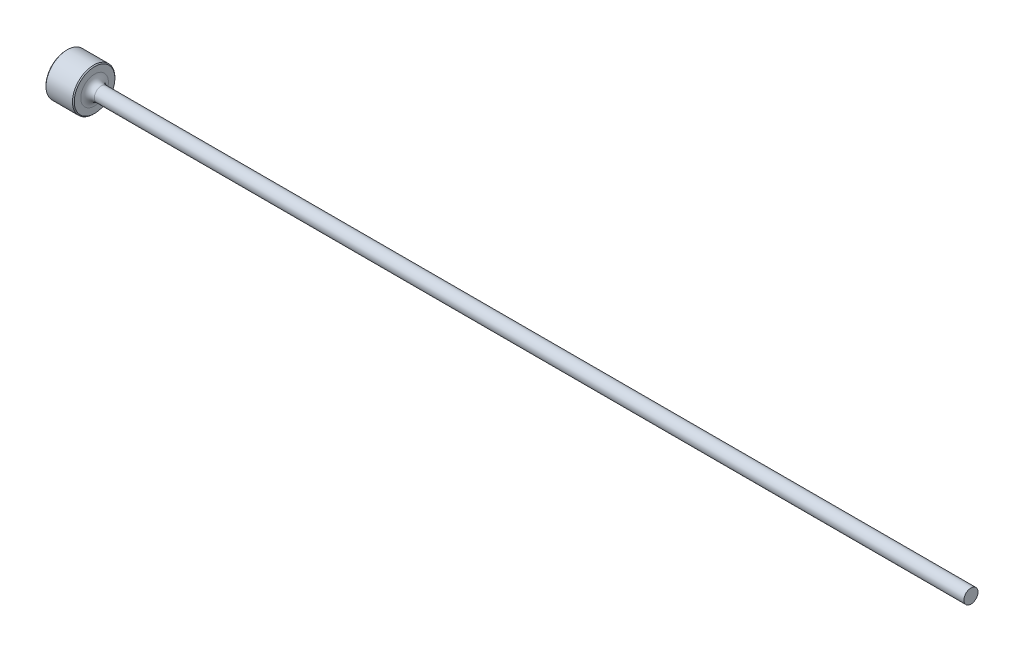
ISO-10303-21;
HEADER;
FILE_DESCRIPTION(('STEP AP214'),'2;1');
FILE_NAME('part.step','',(''),(''),'','','');
FILE_SCHEMA(('AUTOMOTIVE_DESIGN { 1 0 10303 214 1 1 1 1 }'));
ENDSEC;
DATA;
#1=APPLICATION_CONTEXT('core data for automotive mechanical design processes');
#2=APPLICATION_PROTOCOL_DEFINITION('international standard','automotive_design',2000,#1);
#3=PRODUCT_CONTEXT('',#1,'mechanical');
#4=PRODUCT('Part','Part','',(#3));
#5=PRODUCT_RELATED_PRODUCT_CATEGORY('part','',(#4));
#6=PRODUCT_DEFINITION_FORMATION('','',#4);
#7=PRODUCT_DEFINITION_CONTEXT('part definition',#1,'design');
#8=PRODUCT_DEFINITION('design','',#6,#7);
#9=PRODUCT_DEFINITION_SHAPE('','',#8);
#10=(LENGTH_UNIT() NAMED_UNIT(*) SI_UNIT(.MILLI.,.METRE.));
#11=(NAMED_UNIT(*) PLANE_ANGLE_UNIT() SI_UNIT($,.RADIAN.));
#12=(NAMED_UNIT(*) SI_UNIT($,.STERADIAN.) SOLID_ANGLE_UNIT());
#13=UNCERTAINTY_MEASURE_WITH_UNIT(LENGTH_MEASURE(1.E-05),#10,'distance_accuracy_value','');
#14=(GEOMETRIC_REPRESENTATION_CONTEXT(3) GLOBAL_UNCERTAINTY_ASSIGNED_CONTEXT((#13)) GLOBAL_UNIT_ASSIGNED_CONTEXT((#10,
#11,#12)) REPRESENTATION_CONTEXT('',''));
#15=CARTESIAN_POINT('',(0.,0.,0.));
#16=DIRECTION('',(0.,0.,1.));
#17=DIRECTION('',(1.,0.,0.));
#18=AXIS2_PLACEMENT_3D('',#15,#16,#17);
#19=CARTESIAN_POINT('',(101.6,0.789939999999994,0.));
#20=DIRECTION('',(1.,0.,0.));
#21=DIRECTION('',(0.,1.,0.));
#22=AXIS2_PLACEMENT_3D('',#19,#20,#21);
#23=PLANE('',#22);
#24=CARTESIAN_POINT('',(101.6,0.,0.));
#25=DIRECTION('',(1.,0.,0.));
#26=DIRECTION('',(0.,1.,0.));
#27=AXIS2_PLACEMENT_3D('',#24,#25,#26);
#28=CIRCLE('',#27,0.78994);
#29=CARTESIAN_POINT('',(101.6,0.789939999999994,0.));
#30=VERTEX_POINT('',#29);
#31=EDGE_CURVE('E50',#30,#30,#28,.T.);
#32=ORIENTED_EDGE('',*,*,#31,.T.);
#33=EDGE_LOOP('',(#32));
#34=FACE_BOUND('',#33,.T.);
#35=ADVANCED_FACE('F30',(#34),#23,.T.);
#36=CARTESIAN_POINT('',(101.6,0.,0.));
#37=DIRECTION('',(1.,0.,0.));
#38=DIRECTION('',(0.,1.,0.));
#39=AXIS2_PLACEMENT_3D('',#36,#37,#38);
#40=CYLINDRICAL_SURFACE('',#39,0.789939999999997);
#41=CARTESIAN_POINT('',(3.937,0.,0.));
#42=DIRECTION('',(1.,0.,0.));
#43=DIRECTION('',(0.,1.,0.));
#44=AXIS2_PLACEMENT_3D('',#41,#42,#43);
#45=CIRCLE('',#44,0.789939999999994);
#46=CARTESIAN_POINT('',(3.937,0.789939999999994,0.));
#47=VERTEX_POINT('',#46);
#48=EDGE_CURVE('E53',#47,#47,#45,.T.);
#49=ORIENTED_EDGE('',*,*,#48,.T.);
#50=EDGE_LOOP('',(#49));
#51=FACE_BOUND('',#50,.T.);
#52=ORIENTED_EDGE('',*,*,#31,.F.);
#53=EDGE_LOOP('',(#52));
#54=FACE_BOUND('',#53,.T.);
#55=ADVANCED_FACE('F74',(#51,#54),#40,.T.);
#56=CARTESIAN_POINT('',(3.937,0.,0.));
#57=DIRECTION('',(1.,0.,0.));
#58=DIRECTION('',(0.,1.,0.));
#59=AXIS2_PLACEMENT_3D('',#56,#57,#58);
#60=TOROIDAL_SURFACE('',#59,1.55193999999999,0.762);
#61=CARTESIAN_POINT('',(3.175,0.,0.));
#62=DIRECTION('',(1.,0.,0.));
#63=DIRECTION('',(0.,1.,0.));
#64=AXIS2_PLACEMENT_3D('',#61,#62,#63);
#65=CIRCLE('',#64,1.55193999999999);
#66=CARTESIAN_POINT('',(3.175,1.55193999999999,0.));
#67=VERTEX_POINT('',#66);
#68=EDGE_CURVE('E56',#67,#67,#65,.T.);
#69=ORIENTED_EDGE('',*,*,#68,.T.);
#70=EDGE_LOOP('',(#69));
#71=FACE_BOUND('',#70,.T.);
#72=ORIENTED_EDGE('',*,*,#48,.F.);
#73=EDGE_LOOP('',(#72));
#74=FACE_BOUND('',#73,.T.);
#75=ADVANCED_FACE('F60',(#71,#74),#60,.F.);
#76=CARTESIAN_POINT('',(3.175,2.38125,0.));
#77=DIRECTION('',(1.,0.,0.));
#78=DIRECTION('',(0.,1.,0.));
#79=AXIS2_PLACEMENT_3D('',#76,#77,#78);
#80=PLANE('',#79);
#81=CARTESIAN_POINT('',(3.175,0.,0.));
#82=DIRECTION('',(1.,0.,0.));
#83=DIRECTION('',(0.,1.,0.));
#84=AXIS2_PLACEMENT_3D('',#81,#82,#83);
#85=CIRCLE('',#84,2.27964999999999);
#86=CARTESIAN_POINT('',(3.175,2.27964999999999,0.));
#87=VERTEX_POINT('',#86);
#88=EDGE_CURVE('E10',#87,#87,#85,.T.);
#89=ORIENTED_EDGE('',*,*,#88,.T.);
#90=EDGE_LOOP('',(#89));
#91=FACE_BOUND('',#90,.T.);
#92=ORIENTED_EDGE('',*,*,#68,.F.);
#93=EDGE_LOOP('',(#92));
#94=FACE_BOUND('',#93,.T.);
#95=ADVANCED_FACE('F63',(#91,#94),#80,.T.);
#96=CARTESIAN_POINT('',(101.6,0.,0.));
#97=DIRECTION('',(1.,0.,0.));
#98=DIRECTION('',(0.,1.,0.));
#99=AXIS2_PLACEMENT_3D('',#96,#97,#98);
#100=CYLINDRICAL_SURFACE('',#99,2.38125);
#101=CARTESIAN_POINT('',(0.101599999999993,0.,0.));
#102=DIRECTION('',(-1.,0.,0.));
#103=DIRECTION('',(0.,-1.,0.));
#104=AXIS2_PLACEMENT_3D('',#101,#102,#103);
#105=CIRCLE('',#104,2.38125);
#106=CARTESIAN_POINT('',(0.101599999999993,-2.38125,0.));
#107=VERTEX_POINT('',#106);
#108=EDGE_CURVE('E41',#107,#107,#105,.F.);
#109=ORIENTED_EDGE('',*,*,#108,.T.);
#110=EDGE_LOOP('',(#109));
#111=FACE_BOUND('',#110,.T.);
#112=CARTESIAN_POINT('',(3.07339999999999,0.,0.));
#113=DIRECTION('',(1.,0.,0.));
#114=DIRECTION('',(0.,1.,0.));
#115=AXIS2_PLACEMENT_3D('',#112,#113,#114);
#116=CIRCLE('',#115,2.38125);
#117=CARTESIAN_POINT('',(3.07339999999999,2.38125,0.));
#118=VERTEX_POINT('',#117);
#119=EDGE_CURVE('E45',#118,#118,#116,.F.);
#120=ORIENTED_EDGE('',*,*,#119,.T.);
#121=EDGE_LOOP('',(#120));
#122=FACE_BOUND('',#121,.T.);
#123=ADVANCED_FACE('F65',(#111,#122),#100,.T.);
#124=CARTESIAN_POINT('',(0.,0.,0.));
#125=DIRECTION('',(-1.,0.,0.));
#126=DIRECTION('',(0.,-1.,0.));
#127=AXIS2_PLACEMENT_3D('',#124,#125,#126);
#128=PLANE('',#127);
#129=CARTESIAN_POINT('',(0.,0.,0.));
#130=DIRECTION('',(-1.,0.,0.));
#131=DIRECTION('',(0.,-1.,0.));
#132=AXIS2_PLACEMENT_3D('',#129,#130,#131);
#133=CIRCLE('',#132,2.27964999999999);
#134=CARTESIAN_POINT('',(0.,-2.27964999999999,0.));
#135=VERTEX_POINT('',#134);
#136=EDGE_CURVE('E37',#135,#135,#133,.T.);
#137=ORIENTED_EDGE('',*,*,#136,.T.);
#138=EDGE_LOOP('',(#137));
#139=FACE_BOUND('',#138,.T.);
#140=ADVANCED_FACE('F71',(#139),#128,.T.);
#141=CARTESIAN_POINT('',(0.101599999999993,0.,0.));
#142=DIRECTION('',(1.,0.,0.));
#143=DIRECTION('',(0.,1.,0.));
#144=AXIS2_PLACEMENT_3D('',#141,#142,#143);
#145=CONICAL_SURFACE('',#144,2.38125,0.785398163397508);
#146=ORIENTED_EDGE('',*,*,#136,.F.);
#147=EDGE_LOOP('',(#146));
#148=FACE_BOUND('',#147,.T.);
#149=ORIENTED_EDGE('',*,*,#108,.F.);
#150=EDGE_LOOP('',(#149));
#151=FACE_BOUND('',#150,.T.);
#152=ADVANCED_FACE('F84',(#148,#151),#145,.T.);
#153=CARTESIAN_POINT('',(3.175,0.,0.));
#154=DIRECTION('',(-1.,0.,0.));
#155=DIRECTION('',(0.,-1.,0.));
#156=AXIS2_PLACEMENT_3D('',#153,#154,#155);
#157=CONICAL_SURFACE('',#156,2.27964999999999,0.78539816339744);
#158=ORIENTED_EDGE('',*,*,#119,.F.);
#159=EDGE_LOOP('',(#158));
#160=FACE_BOUND('',#159,.T.);
#161=ORIENTED_EDGE('',*,*,#88,.F.);
#162=EDGE_LOOP('',(#161));
#163=FACE_BOUND('',#162,.T.);
#164=ADVANCED_FACE('F32',(#160,#163),#157,.T.);
#165=CLOSED_SHELL('',(#35,#55,#75,#95,#123,#140,#152,#164));
#166=MANIFOLD_SOLID_BREP('B2',#165);
#167=ADVANCED_BREP_SHAPE_REPRESENTATION('',(#18,#166),#14);
#168=SHAPE_DEFINITION_REPRESENTATION(#9,#167);
ENDSEC;
END-ISO-10303-21;
